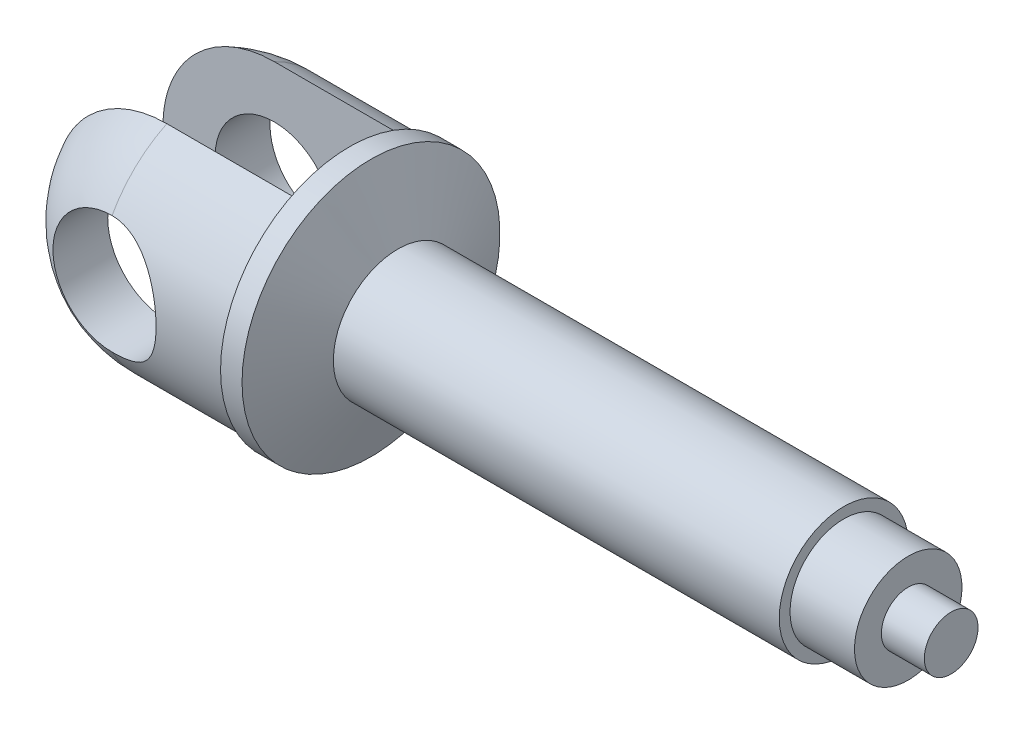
from build123d import *

# Parameters (mm, degrees)
ENL_V_MAT_EXTRU_1_DEPTH      = 10
ENL_V_MAT_EXTRU_1_DEPTH_BACK = 10
ENL_V_MAT_EXTRU_2_DEPTH      = 163.144225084
ENL_V_MAT_EXTRU_2_DEPTH_BACK = 163.144225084
ESQUISSE3_R                  = 11


with BuildPart() as part:
    # Esquisse1 → R_volution1 (revolve)
    with BuildSketch(Plane.XY, mode=Mode.PRIVATE) as r_volution1_sk:
        with BuildLine():
            Line((0, 0), (0, 5))
            Line((0, 5), (-8, 5))
            Line((-8, 5), (-8, 10))
            Line((-8, 10), (-20, 10))
            Line((-20, 10), (-20, 12))
            Line((-20, 12), (-103, 12))
            Line((-103, 12), (-108, 24))
            Line((-108, 24), (-112, 24))
            Line((-112, 24), (-112, 23))
            Line((-112, 23), (-136, 23))
            ThreePointArc((-136, 23), (-152.263455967, 16.263455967), (-159, 0))
            Line((-159, 0), (-136, 0))
            Line((-136, 0), (0, 0))
        make_face()
    revolve(r_volution1_sk.sketch.rotate(Axis((-136, 0, 0), (1, 0, 0)), 90), axis=Axis((-136, 0, 0), (1, 0, 0)))

    # Esquisse2 → Enl_v. mat.-Extru.1 (cut, two sides: drawn at the far end of the back side and taken through both)
    with BuildSketch(Plane.XY.offset(-ENL_V_MAT_EXTRU_1_DEPTH_BACK)):
        Polygon((-112, 29.354770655), (-112, -30.937238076), (-136, -30.937238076), (-169.963272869, -30.937238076), (-169.963272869, 29.354770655), (-136, 29.354770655), align=None)
    extrude(amount=ENL_V_MAT_EXTRU_1_DEPTH + ENL_V_MAT_EXTRU_1_DEPTH_BACK, mode=Mode.SUBTRACT)

    # Esquisse3 → Enl_v. mat.-Extru.2 (cut, two sides: drawn at the far end of the back side and taken through both)
    with BuildSketch(Plane.XY.offset(-10).offset(-ENL_V_MAT_EXTRU_2_DEPTH_BACK)):
        with Locations(Location((-136, 0, 0), (0, 0, 90))):
            Circle(ESQUISSE3_R)
    extrude(amount=ENL_V_MAT_EXTRU_2_DEPTH + ENL_V_MAT_EXTRU_2_DEPTH_BACK, mode=Mode.SUBTRACT)


solid = part.part
